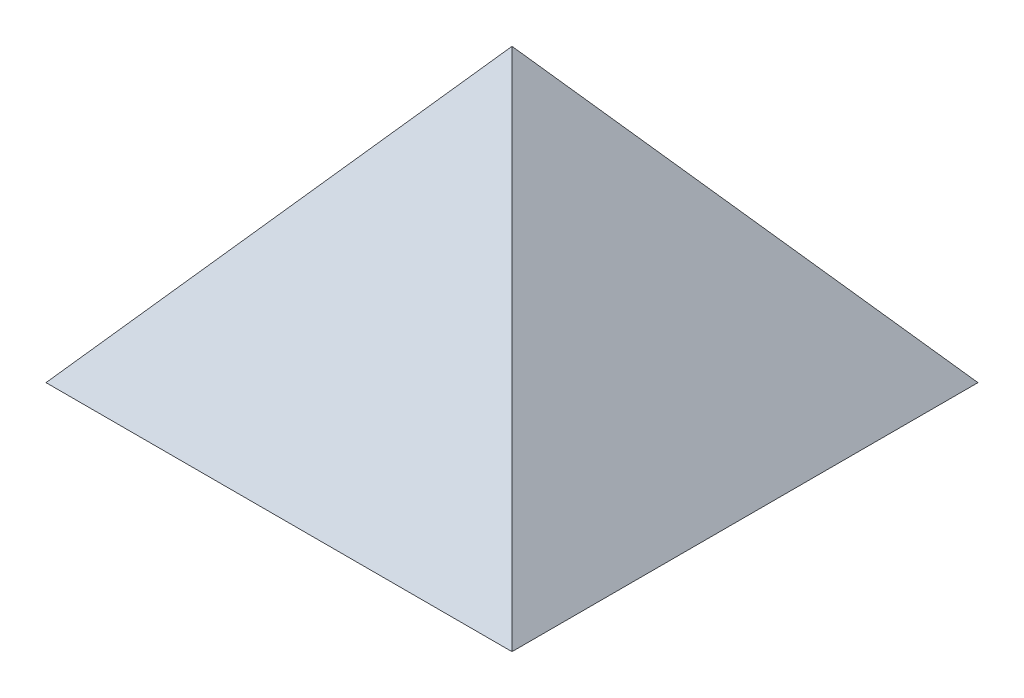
from build123d import *


with BuildPart() as part:
    # Sketch 1 → Loft 1 section 0
    with BuildSketch(Plane(origin=(0, 0, 0), x_dir=(1, 0, 0), z_dir=(0, 1, 0)), mode=Mode.PRIVATE) as loft_1_s0:
        with BuildLine():
            Line((-40, -40), (40, -40))
            Line((40, -40), (40, 40))
            Line((40, 40), (-40, 40))
            Line((-40, 40), (-40, -40))
        make_face()
    loft([loft_1_s0.sketch, Vertex(0, 50, 0)])


solid = part.part
